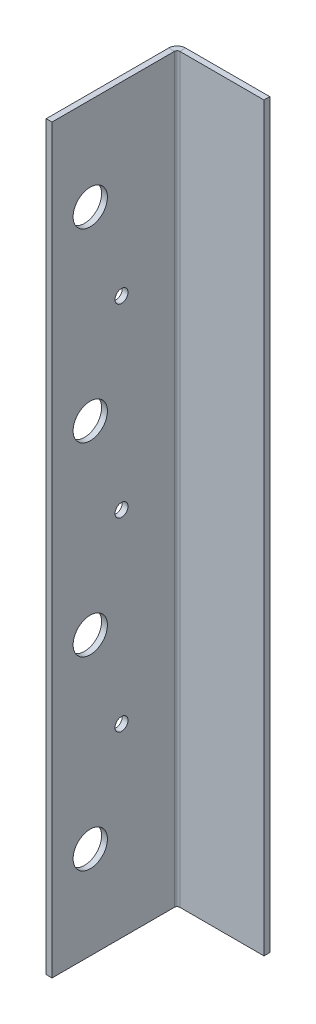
ISO-10303-21;
HEADER;
FILE_DESCRIPTION(('STEP AP214'),'2;1');
FILE_NAME('part.step','',(''),(''),'','','');
FILE_SCHEMA(('AUTOMOTIVE_DESIGN { 1 0 10303 214 1 1 1 1 }'));
ENDSEC;
DATA;
#1=APPLICATION_CONTEXT('core data for automotive mechanical design processes');
#2=APPLICATION_PROTOCOL_DEFINITION('international standard','automotive_design',2000,#1);
#3=PRODUCT_CONTEXT('',#1,'mechanical');
#4=PRODUCT('Part','Part','',(#3));
#5=PRODUCT_RELATED_PRODUCT_CATEGORY('part','',(#4));
#6=PRODUCT_DEFINITION_FORMATION('','',#4);
#7=PRODUCT_DEFINITION_CONTEXT('part definition',#1,'design');
#8=PRODUCT_DEFINITION('design','',#6,#7);
#9=PRODUCT_DEFINITION_SHAPE('','',#8);
#10=(LENGTH_UNIT() NAMED_UNIT(*) SI_UNIT(.MILLI.,.METRE.));
#11=(NAMED_UNIT(*) PLANE_ANGLE_UNIT() SI_UNIT($,.RADIAN.));
#12=(NAMED_UNIT(*) SI_UNIT($,.STERADIAN.) SOLID_ANGLE_UNIT());
#13=UNCERTAINTY_MEASURE_WITH_UNIT(LENGTH_MEASURE(1.E-05),#10,'distance_accuracy_value','');
#14=(GEOMETRIC_REPRESENTATION_CONTEXT(3) GLOBAL_UNCERTAINTY_ASSIGNED_CONTEXT((#13)) GLOBAL_UNIT_ASSIGNED_CONTEXT((#10,
#11,#12)) REPRESENTATION_CONTEXT('',''));
#15=CARTESIAN_POINT('',(0.,0.,0.));
#16=DIRECTION('',(0.,0.,1.));
#17=DIRECTION('',(1.,0.,0.));
#18=AXIS2_PLACEMENT_3D('',#15,#16,#17);
#19=CARTESIAN_POINT('',(-12.7,-101.6,-1.5875));
#20=DIRECTION('',(0.,-1.,0.));
#21=DIRECTION('',(0.,0.,-1.));
#22=AXIS2_PLACEMENT_3D('',#19,#20,#21);
#23=PLANE('',#22);
#24=DIRECTION('',(1.,0.,0.));
#25=VECTOR('',#24,1.);
#26=CARTESIAN_POINT('',(-12.7,-101.6,0.));
#27=LINE('',#26,#25);
#28=CARTESIAN_POINT('',(-10.3759,-101.6,0.));
#29=VERTEX_POINT('',#28);
#30=CARTESIAN_POINT('',(12.7,-101.6,0.));
#31=VERTEX_POINT('',#30);
#32=EDGE_CURVE('E95',#29,#31,#27,.T.);
#33=ORIENTED_EDGE('',*,*,#32,.F.);
#34=DIRECTION('',(0.,0.,-1.));
#35=VECTOR('',#34,1.);
#36=CARTESIAN_POINT('',(-10.3759,-101.6,0.));
#37=LINE('',#36,#35);
#38=CARTESIAN_POINT('',(-10.3759,-101.6,-1.58749999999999));
#39=VERTEX_POINT('',#38);
#40=EDGE_CURVE('E113',#29,#39,#37,.T.);
#41=ORIENTED_EDGE('',*,*,#40,.T.);
#42=DIRECTION('',(1.,0.,0.));
#43=VECTOR('',#42,1.);
#44=CARTESIAN_POINT('',(-12.7,-101.6,-1.5875));
#45=LINE('',#44,#43);
#46=CARTESIAN_POINT('',(12.7,-101.6,-1.5875));
#47=VERTEX_POINT('',#46);
#48=EDGE_CURVE('E80',#39,#47,#45,.T.);
#49=ORIENTED_EDGE('',*,*,#48,.T.);
#50=DIRECTION('',(0.,0.,1.));
#51=VECTOR('',#50,1.);
#52=CARTESIAN_POINT('',(12.7,-101.6,-1.5875));
#53=LINE('',#52,#51);
#54=EDGE_CURVE('E13',#47,#31,#53,.T.);
#55=ORIENTED_EDGE('',*,*,#54,.T.);
#56=EDGE_LOOP('',(#33,#41,#49,#55));
#57=FACE_BOUND('',#56,.T.);
#58=ADVANCED_FACE('F57',(#57),#23,.T.);
#59=CARTESIAN_POINT('',(0.,0.,-1.5875));
#60=DIRECTION('',(0.,0.,-1.));
#61=DIRECTION('',(-1.,0.,0.));
#62=AXIS2_PLACEMENT_3D('',#59,#60,#61);
#63=PLANE('',#62);
#64=ORIENTED_EDGE('',*,*,#48,.F.);
#65=DIRECTION('',(0.,-1.,0.));
#66=VECTOR('',#65,1.);
#67=CARTESIAN_POINT('',(-10.3759,-101.6,-1.58749999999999));
#68=LINE('',#67,#66);
#69=CARTESIAN_POINT('',(-10.3759,101.6,-1.5875));
#70=VERTEX_POINT('',#69);
#71=EDGE_CURVE('E133',#39,#70,#68,.F.);
#72=ORIENTED_EDGE('',*,*,#71,.T.);
#73=DIRECTION('',(-1.,0.,0.));
#74=VECTOR('',#73,1.);
#75=CARTESIAN_POINT('',(-12.7,101.6,-1.5875));
#76=LINE('',#75,#74);
#77=CARTESIAN_POINT('',(12.7,101.6,-1.5875));
#78=VERTEX_POINT('',#77);
#79=EDGE_CURVE('E117',#78,#70,#76,.T.);
#80=ORIENTED_EDGE('',*,*,#79,.F.);
#81=DIRECTION('',(0.,1.,0.));
#82=VECTOR('',#81,1.);
#83=CARTESIAN_POINT('',(12.7,-101.6,-1.5875));
#84=LINE('',#83,#82);
#85=EDGE_CURVE('E103',#47,#78,#84,.T.);
#86=ORIENTED_EDGE('',*,*,#85,.F.);
#87=EDGE_LOOP('',(#64,#72,#80,#86));
#88=FACE_BOUND('',#87,.T.);
#89=ADVANCED_FACE('F283',(#88),#63,.T.);
#90=CARTESIAN_POINT('',(0.,0.,0.));
#91=DIRECTION('',(0.,0.,-1.));
#92=DIRECTION('',(-1.,0.,0.));
#93=AXIS2_PLACEMENT_3D('',#90,#91,#92);
#94=PLANE('',#93);
#95=DIRECTION('',(0.,-1.,0.));
#96=VECTOR('',#95,1.);
#97=CARTESIAN_POINT('',(-10.3759,-101.6,0.));
#98=LINE('',#97,#96);
#99=CARTESIAN_POINT('',(-10.3759,101.6,0.));
#100=VERTEX_POINT('',#99);
#101=EDGE_CURVE('E102',#29,#100,#98,.F.);
#102=ORIENTED_EDGE('',*,*,#101,.F.);
#103=ORIENTED_EDGE('',*,*,#32,.T.);
#104=DIRECTION('',(0.,1.,0.));
#105=VECTOR('',#104,1.);
#106=CARTESIAN_POINT('',(12.7,-101.6,0.));
#107=LINE('',#106,#105);
#108=CARTESIAN_POINT('',(12.7,101.6,0.));
#109=VERTEX_POINT('',#108);
#110=EDGE_CURVE('E99',#31,#109,#107,.T.);
#111=ORIENTED_EDGE('',*,*,#110,.T.);
#112=DIRECTION('',(-1.,0.,0.));
#113=VECTOR('',#112,1.);
#114=CARTESIAN_POINT('',(-12.7,101.6,0.));
#115=LINE('',#114,#113);
#116=EDGE_CURVE('E104',#109,#100,#115,.T.);
#117=ORIENTED_EDGE('',*,*,#116,.T.);
#118=EDGE_LOOP('',(#102,#103,#111,#117));
#119=FACE_BOUND('',#118,.T.);
#120=ADVANCED_FACE('F96',(#119),#94,.F.);
#121=CARTESIAN_POINT('',(12.7,-101.6,-1.5875));
#122=DIRECTION('',(1.,0.,0.));
#123=DIRECTION('',(0.,0.,-1.));
#124=AXIS2_PLACEMENT_3D('',#121,#122,#123);
#125=PLANE('',#124);
#126=ORIENTED_EDGE('',*,*,#110,.F.);
#127=ORIENTED_EDGE('',*,*,#54,.F.);
#128=ORIENTED_EDGE('',*,*,#85,.T.);
#129=DIRECTION('',(0.,0.,1.));
#130=VECTOR('',#129,1.);
#131=CARTESIAN_POINT('',(12.7,101.6,-1.5875));
#132=LINE('',#131,#130);
#133=EDGE_CURVE('E61',#78,#109,#132,.T.);
#134=ORIENTED_EDGE('',*,*,#133,.T.);
#135=EDGE_LOOP('',(#126,#127,#128,#134));
#136=FACE_BOUND('',#135,.T.);
#137=ADVANCED_FACE('F59',(#136),#125,.T.);
#138=CARTESIAN_POINT('',(-12.7,101.6,-1.5875));
#139=DIRECTION('',(0.,1.,0.));
#140=DIRECTION('',(0.,0.,1.));
#141=AXIS2_PLACEMENT_3D('',#138,#139,#140);
#142=PLANE('',#141);
#143=DIRECTION('',(0.,0.,-1.));
#144=VECTOR('',#143,1.);
#145=CARTESIAN_POINT('',(-10.3759,101.6,0.));
#146=LINE('',#145,#144);
#147=EDGE_CURVE('E110',#100,#70,#146,.T.);
#148=ORIENTED_EDGE('',*,*,#147,.F.);
#149=ORIENTED_EDGE('',*,*,#116,.F.);
#150=ORIENTED_EDGE('',*,*,#133,.F.);
#151=ORIENTED_EDGE('',*,*,#79,.T.);
#152=EDGE_LOOP('',(#148,#149,#150,#151));
#153=FACE_BOUND('',#152,.T.);
#154=ADVANCED_FACE('F280',(#153),#142,.T.);
#155=CARTESIAN_POINT('',(-10.3759,101.6,0.736599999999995));
#156=DIRECTION('',(0.,1.,0.));
#157=DIRECTION('',(0.,0.,1.));
#158=AXIS2_PLACEMENT_3D('',#155,#156,#157);
#159=PLANE('',#158);
#160=DIRECTION('',(1.,0.,0.));
#161=VECTOR('',#160,1.);
#162=CARTESIAN_POINT('',(-12.7,101.6,0.736599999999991));
#163=LINE('',#162,#161);
#164=CARTESIAN_POINT('',(-11.1125,101.6,0.736599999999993));
#165=VERTEX_POINT('',#164);
#166=CARTESIAN_POINT('',(-12.7,101.6,0.736599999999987));
#167=VERTEX_POINT('',#166);
#168=EDGE_CURVE('E137',#165,#167,#163,.F.);
#169=ORIENTED_EDGE('',*,*,#168,.F.);
#170=CARTESIAN_POINT('',(-10.3759,101.6,0.736599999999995));
#171=DIRECTION('',(0.,-1.,0.));
#172=DIRECTION('',(0.,0.,-1.));
#173=AXIS2_PLACEMENT_3D('',#170,#171,#172);
#174=CIRCLE('',#173,0.7366);
#175=EDGE_CURVE('E127',#100,#165,#174,.F.);
#176=ORIENTED_EDGE('',*,*,#175,.F.);
#177=ORIENTED_EDGE('',*,*,#147,.T.);
#178=CARTESIAN_POINT('',(-10.3759,101.6,0.736599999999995));
#179=DIRECTION('',(0.,-1.,0.));
#180=DIRECTION('',(0.,0.,-1.));
#181=AXIS2_PLACEMENT_3D('',#178,#179,#180);
#182=CIRCLE('',#181,2.3241);
#183=EDGE_CURVE('E72',#70,#167,#182,.F.);
#184=ORIENTED_EDGE('',*,*,#183,.T.);
#185=EDGE_LOOP('',(#169,#176,#177,#184));
#186=FACE_BOUND('',#185,.T.);
#187=ADVANCED_FACE('F277',(#186),#159,.T.);
#188=CARTESIAN_POINT('',(-10.3759,-101.6,0.73660000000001));
#189=DIRECTION('',(0.,1.,0.));
#190=DIRECTION('',(0.,0.,1.));
#191=AXIS2_PLACEMENT_3D('',#188,#189,#190);
#192=PLANE('',#191);
#193=CARTESIAN_POINT('',(-10.3759,-101.6,0.73660000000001));
#194=DIRECTION('',(0.,-1.,0.));
#195=DIRECTION('',(0.,0.,-1.));
#196=AXIS2_PLACEMENT_3D('',#193,#194,#195);
#197=CIRCLE('',#196,0.7366);
#198=CARTESIAN_POINT('',(-11.1125,-101.6,0.736600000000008));
#199=VERTEX_POINT('',#198);
#200=EDGE_CURVE('E122',#199,#29,#197,.T.);
#201=ORIENTED_EDGE('',*,*,#200,.F.);
#202=DIRECTION('',(1.,0.,0.));
#203=VECTOR('',#202,1.);
#204=CARTESIAN_POINT('',(-11.1125,-101.6,0.736600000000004));
#205=LINE('',#204,#203);
#206=CARTESIAN_POINT('',(-12.7,-101.6,0.736599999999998));
#207=VERTEX_POINT('',#206);
#208=EDGE_CURVE('E144',#199,#207,#205,.F.);
#209=ORIENTED_EDGE('',*,*,#208,.T.);
#210=CARTESIAN_POINT('',(-10.3759,-101.6,0.73660000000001));
#211=DIRECTION('',(0.,-1.,0.));
#212=DIRECTION('',(0.,0.,-1.));
#213=AXIS2_PLACEMENT_3D('',#210,#211,#212);
#214=CIRCLE('',#213,2.3241);
#215=EDGE_CURVE('E130',#207,#39,#214,.T.);
#216=ORIENTED_EDGE('',*,*,#215,.T.);
#217=ORIENTED_EDGE('',*,*,#40,.F.);
#218=EDGE_LOOP('',(#201,#209,#216,#217));
#219=FACE_BOUND('',#218,.T.);
#220=ADVANCED_FACE('F272',(#219),#192,.F.);
#221=CARTESIAN_POINT('',(-10.3759,-101.6,0.73660000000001));
#222=DIRECTION('',(0.,-1.,0.));
#223=DIRECTION('',(-1.,0.,0.));
#224=AXIS2_PLACEMENT_3D('',#221,#222,#223);
#225=CYLINDRICAL_SURFACE('',#224,2.3241);
#226=ORIENTED_EDGE('',*,*,#71,.F.);
#227=ORIENTED_EDGE('',*,*,#215,.F.);
#228=DIRECTION('',(0.,-1.,0.));
#229=VECTOR('',#228,1.);
#230=CARTESIAN_POINT('',(-12.7,101.6,0.736599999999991));
#231=LINE('',#230,#229);
#232=EDGE_CURVE('E147',#207,#167,#231,.F.);
#233=ORIENTED_EDGE('',*,*,#232,.T.);
#234=ORIENTED_EDGE('',*,*,#183,.F.);
#235=EDGE_LOOP('',(#226,#227,#233,#234));
#236=FACE_BOUND('',#235,.T.);
#237=ADVANCED_FACE('F284',(#236),#225,.T.);
#238=CARTESIAN_POINT('',(-10.3759,-101.6,0.73660000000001));
#239=DIRECTION('',(0.,-1.,0.));
#240=DIRECTION('',(-1.,0.,0.));
#241=AXIS2_PLACEMENT_3D('',#238,#239,#240);
#242=CYLINDRICAL_SURFACE('',#241,0.7366);
#243=ORIENTED_EDGE('',*,*,#101,.T.);
#244=ORIENTED_EDGE('',*,*,#175,.T.);
#245=DIRECTION('',(0.,-1.,0.));
#246=VECTOR('',#245,1.);
#247=CARTESIAN_POINT('',(-11.1125,101.6,0.736599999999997));
#248=LINE('',#247,#246);
#249=EDGE_CURVE('E140',#165,#199,#248,.T.);
#250=ORIENTED_EDGE('',*,*,#249,.T.);
#251=ORIENTED_EDGE('',*,*,#200,.T.);
#252=EDGE_LOOP('',(#243,#244,#250,#251));
#253=FACE_BOUND('',#252,.T.);
#254=ADVANCED_FACE('F274',(#253),#242,.F.);
#255=CARTESIAN_POINT('',(-12.7000000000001,-101.6,34.29));
#256=DIRECTION('',(0.,1.,0.));
#257=DIRECTION('',(0.,0.,1.));
#258=AXIS2_PLACEMENT_3D('',#255,#256,#257);
#259=PLANE('',#258);
#260=ORIENTED_EDGE('',*,*,#208,.F.);
#261=DIRECTION('',(0.,0.,-1.));
#262=VECTOR('',#261,1.);
#263=CARTESIAN_POINT('',(-11.1125000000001,-101.6,34.29));
#264=LINE('',#263,#262);
#265=CARTESIAN_POINT('',(-11.1125000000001,-101.6,34.29));
#266=VERTEX_POINT('',#265);
#267=EDGE_CURVE('E149',#199,#266,#264,.F.);
#268=ORIENTED_EDGE('',*,*,#267,.T.);
#269=DIRECTION('',(1.,0.,0.));
#270=VECTOR('',#269,1.);
#271=CARTESIAN_POINT('',(-12.7000000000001,-101.6,34.29));
#272=LINE('',#271,#270);
#273=CARTESIAN_POINT('',(-12.7000000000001,-101.6,34.29));
#274=VERTEX_POINT('',#273);
#275=EDGE_CURVE('E125',#274,#266,#272,.T.);
#276=ORIENTED_EDGE('',*,*,#275,.F.);
#277=DIRECTION('',(0.,0.,1.));
#278=VECTOR('',#277,1.);
#279=CARTESIAN_POINT('',(-12.7,-101.6,0.));
#280=LINE('',#279,#278);
#281=EDGE_CURVE('E158',#207,#274,#280,.T.);
#282=ORIENTED_EDGE('',*,*,#281,.F.);
#283=EDGE_LOOP('',(#260,#268,#276,#282));
#284=FACE_BOUND('',#283,.T.);
#285=ADVANCED_FACE('F243',(#284),#259,.F.);
#286=CARTESIAN_POINT('',(-12.7,101.6,0.));
#287=DIRECTION('',(0.,-1.,0.));
#288=DIRECTION('',(0.,0.,-1.));
#289=AXIS2_PLACEMENT_3D('',#286,#287,#288);
#290=PLANE('',#289);
#291=ORIENTED_EDGE('',*,*,#168,.T.);
#292=DIRECTION('',(0.,0.,-1.));
#293=VECTOR('',#292,1.);
#294=CARTESIAN_POINT('',(-12.7,101.6,0.));
#295=LINE('',#294,#293);
#296=CARTESIAN_POINT('',(-12.7000000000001,101.6,34.29));
#297=VERTEX_POINT('',#296);
#298=EDGE_CURVE('E164',#297,#167,#295,.T.);
#299=ORIENTED_EDGE('',*,*,#298,.F.);
#300=DIRECTION('',(1.,0.,0.));
#301=VECTOR('',#300,1.);
#302=CARTESIAN_POINT('',(-12.7000000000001,101.6,34.29));
#303=LINE('',#302,#301);
#304=CARTESIAN_POINT('',(-11.1125000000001,101.6,34.29));
#305=VERTEX_POINT('',#304);
#306=EDGE_CURVE('E167',#297,#305,#303,.T.);
#307=ORIENTED_EDGE('',*,*,#306,.T.);
#308=DIRECTION('',(0.,0.,1.));
#309=VECTOR('',#308,1.);
#310=CARTESIAN_POINT('',(-11.1125,101.6,0.));
#311=LINE('',#310,#309);
#312=EDGE_CURVE('E155',#305,#165,#311,.F.);
#313=ORIENTED_EDGE('',*,*,#312,.T.);
#314=EDGE_LOOP('',(#291,#299,#307,#313));
#315=FACE_BOUND('',#314,.T.);
#316=ADVANCED_FACE('F286',(#315),#290,.F.);
#317=CARTESIAN_POINT('',(-12.7,0.,0.));
#318=DIRECTION('',(1.,0.,0.));
#319=DIRECTION('',(0.,0.,-1.));
#320=AXIS2_PLACEMENT_3D('',#317,#318,#319);
#321=PLANE('',#320);
#322=CARTESIAN_POINT('',(-12.7000000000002,76.1999999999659,23.8125000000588));
#323=DIRECTION('',(1.,0.,0.));
#324=DIRECTION('',(0.,0.,-1.));
#325=AXIS2_PLACEMENT_3D('',#322,#323,#324);
#326=CIRCLE('',#325,4.69900000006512);
#327=CARTESIAN_POINT('',(-12.7000000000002,76.1999999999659,19.1134999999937));
#328=VERTEX_POINT('',#327);
#329=EDGE_CURVE('E181',#328,#328,#326,.T.);
#330=ORIENTED_EDGE('',*,*,#329,.T.);
#331=EDGE_LOOP('',(#330));
#332=FACE_BOUND('',#331,.T.);
#333=CARTESIAN_POINT('',(-12.7000000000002,25.3999999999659,23.8125000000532));
#334=DIRECTION('',(1.,0.,0.));
#335=DIRECTION('',(0.,0.,-1.));
#336=AXIS2_PLACEMENT_3D('',#333,#334,#335);
#337=CIRCLE('',#336,4.69900000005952);
#338=CARTESIAN_POINT('',(-12.7000000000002,25.3999999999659,19.1134999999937));
#339=VERTEX_POINT('',#338);
#340=EDGE_CURVE('E187',#339,#339,#337,.T.);
#341=ORIENTED_EDGE('',*,*,#340,.T.);
#342=EDGE_LOOP('',(#341));
#343=FACE_BOUND('',#342,.T.);
#344=CARTESIAN_POINT('',(-12.7000000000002,-25.4000000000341,23.8125000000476));
#345=DIRECTION('',(1.,0.,0.));
#346=DIRECTION('',(0.,0.,-1.));
#347=AXIS2_PLACEMENT_3D('',#344,#345,#346);
#348=CIRCLE('',#347,4.69900000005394);
#349=CARTESIAN_POINT('',(-12.7000000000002,-25.4000000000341,19.1134999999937));
#350=VERTEX_POINT('',#349);
#351=EDGE_CURVE('E193',#350,#350,#348,.T.);
#352=ORIENTED_EDGE('',*,*,#351,.T.);
#353=EDGE_LOOP('',(#352));
#354=FACE_BOUND('',#353,.T.);
#355=CARTESIAN_POINT('',(-12.7000000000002,-76.2000000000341,23.812500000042));
#356=DIRECTION('',(1.,0.,0.));
#357=DIRECTION('',(0.,0.,-1.));
#358=AXIS2_PLACEMENT_3D('',#355,#356,#357);
#359=CIRCLE('',#358,4.69900000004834);
#360=CARTESIAN_POINT('',(-12.7000000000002,-76.2000000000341,19.1134999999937));
#361=VERTEX_POINT('',#360);
#362=EDGE_CURVE('E199',#361,#361,#359,.T.);
#363=ORIENTED_EDGE('',*,*,#362,.T.);
#364=EDGE_LOOP('',(#363));
#365=FACE_BOUND('',#364,.T.);
#366=CARTESIAN_POINT('',(-12.7000000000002,-50.7999999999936,15.24));
#367=DIRECTION('',(1.,0.,0.));
#368=DIRECTION('',(0.,0.,-1.));
#369=AXIS2_PLACEMENT_3D('',#366,#367,#368);
#370=CIRCLE('',#369,1.77799999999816);
#371=CARTESIAN_POINT('',(-12.7000000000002,-50.7999999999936,13.4620000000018));
#372=VERTEX_POINT('',#371);
#373=EDGE_CURVE('E205',#372,#372,#370,.T.);
#374=ORIENTED_EDGE('',*,*,#373,.T.);
#375=EDGE_LOOP('',(#374));
#376=FACE_BOUND('',#375,.T.);
#377=CARTESIAN_POINT('',(-12.7000000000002,0.,15.24));
#378=DIRECTION('',(1.,0.,0.));
#379=DIRECTION('',(0.,0.,-1.));
#380=AXIS2_PLACEMENT_3D('',#377,#378,#379);
#381=CIRCLE('',#380,1.778);
#382=CARTESIAN_POINT('',(-12.7000000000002,0.,13.462));
#383=VERTEX_POINT('',#382);
#384=EDGE_CURVE('E175',#383,#383,#381,.T.);
#385=ORIENTED_EDGE('',*,*,#384,.T.);
#386=EDGE_LOOP('',(#385));
#387=FACE_BOUND('',#386,.T.);
#388=CARTESIAN_POINT('',(-12.7000000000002,50.7999999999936,15.24));
#389=DIRECTION('',(1.,0.,0.));
#390=DIRECTION('',(0.,0.,-1.));
#391=AXIS2_PLACEMENT_3D('',#388,#389,#390);
#392=CIRCLE('',#391,1.77800000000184);
#393=CARTESIAN_POINT('',(-12.7000000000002,50.7999999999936,13.4619999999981));
#394=VERTEX_POINT('',#393);
#395=EDGE_CURVE('E141',#394,#394,#392,.T.);
#396=ORIENTED_EDGE('',*,*,#395,.T.);
#397=EDGE_LOOP('',(#396));
#398=FACE_BOUND('',#397,.T.);
#399=ORIENTED_EDGE('',*,*,#232,.F.);
#400=ORIENTED_EDGE('',*,*,#281,.T.);
#401=DIRECTION('',(0.,1.,0.));
#402=VECTOR('',#401,1.);
#403=CARTESIAN_POINT('',(-12.7000000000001,0.,34.29));
#404=LINE('',#403,#402);
#405=EDGE_CURVE('E161',#274,#297,#404,.T.);
#406=ORIENTED_EDGE('',*,*,#405,.T.);
#407=ORIENTED_EDGE('',*,*,#298,.T.);
#408=EDGE_LOOP('',(#399,#400,#406,#407));
#409=FACE_BOUND('',#408,.T.);
#410=ADVANCED_FACE('F214',(#332,#343,#354,#365,#376,#387,#398,#409),#321,.F.);
#411=CARTESIAN_POINT('',(-11.1125,0.,0.));
#412=DIRECTION('',(1.,0.,0.));
#413=DIRECTION('',(0.,0.,-1.));
#414=AXIS2_PLACEMENT_3D('',#411,#412,#413);
#415=PLANE('',#414);
#416=CARTESIAN_POINT('',(-11.1125000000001,76.1999999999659,23.8125000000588));
#417=DIRECTION('',(1.,0.,0.));
#418=DIRECTION('',(0.,0.,-1.));
#419=AXIS2_PLACEMENT_3D('',#416,#417,#418);
#420=CIRCLE('',#419,4.69900000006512);
#421=CARTESIAN_POINT('',(-11.1125000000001,76.1999999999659,19.1134999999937));
#422=VERTEX_POINT('',#421);
#423=EDGE_CURVE('E178',#422,#422,#420,.T.);
#424=ORIENTED_EDGE('',*,*,#423,.F.);
#425=EDGE_LOOP('',(#424));
#426=FACE_BOUND('',#425,.T.);
#427=CARTESIAN_POINT('',(-11.1125000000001,25.3999999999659,23.8125000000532));
#428=DIRECTION('',(1.,0.,0.));
#429=DIRECTION('',(0.,0.,-1.));
#430=AXIS2_PLACEMENT_3D('',#427,#428,#429);
#431=CIRCLE('',#430,4.69900000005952);
#432=CARTESIAN_POINT('',(-11.1125000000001,25.3999999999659,19.1134999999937));
#433=VERTEX_POINT('',#432);
#434=EDGE_CURVE('E184',#433,#433,#431,.T.);
#435=ORIENTED_EDGE('',*,*,#434,.F.);
#436=EDGE_LOOP('',(#435));
#437=FACE_BOUND('',#436,.T.);
#438=CARTESIAN_POINT('',(-11.1125000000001,-25.4000000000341,23.8125000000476));
#439=DIRECTION('',(1.,0.,0.));
#440=DIRECTION('',(0.,0.,-1.));
#441=AXIS2_PLACEMENT_3D('',#438,#439,#440);
#442=CIRCLE('',#441,4.69900000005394);
#443=CARTESIAN_POINT('',(-11.1125000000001,-25.4000000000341,19.1134999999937));
#444=VERTEX_POINT('',#443);
#445=EDGE_CURVE('E190',#444,#444,#442,.T.);
#446=ORIENTED_EDGE('',*,*,#445,.F.);
#447=EDGE_LOOP('',(#446));
#448=FACE_BOUND('',#447,.T.);
#449=CARTESIAN_POINT('',(-11.1125000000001,-76.2000000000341,23.812500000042));
#450=DIRECTION('',(1.,0.,0.));
#451=DIRECTION('',(0.,0.,-1.));
#452=AXIS2_PLACEMENT_3D('',#449,#450,#451);
#453=CIRCLE('',#452,4.69900000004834);
#454=CARTESIAN_POINT('',(-11.1125000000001,-76.2000000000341,19.1134999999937));
#455=VERTEX_POINT('',#454);
#456=EDGE_CURVE('E196',#455,#455,#453,.T.);
#457=ORIENTED_EDGE('',*,*,#456,.F.);
#458=EDGE_LOOP('',(#457));
#459=FACE_BOUND('',#458,.T.);
#460=CARTESIAN_POINT('',(-11.1125000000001,-50.7999999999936,15.24));
#461=DIRECTION('',(1.,0.,0.));
#462=DIRECTION('',(0.,0.,-1.));
#463=AXIS2_PLACEMENT_3D('',#460,#461,#462);
#464=CIRCLE('',#463,1.77799999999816);
#465=CARTESIAN_POINT('',(-11.1125,-50.7999999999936,13.4620000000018));
#466=VERTEX_POINT('',#465);
#467=EDGE_CURVE('E202',#466,#466,#464,.T.);
#468=ORIENTED_EDGE('',*,*,#467,.F.);
#469=EDGE_LOOP('',(#468));
#470=FACE_BOUND('',#469,.T.);
#471=CARTESIAN_POINT('',(-11.1125000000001,0.,15.24));
#472=DIRECTION('',(1.,0.,0.));
#473=DIRECTION('',(0.,0.,-1.));
#474=AXIS2_PLACEMENT_3D('',#471,#472,#473);
#475=CIRCLE('',#474,1.778);
#476=CARTESIAN_POINT('',(-11.1125,0.,13.462));
#477=VERTEX_POINT('',#476);
#478=EDGE_CURVE('E208',#477,#477,#475,.T.);
#479=ORIENTED_EDGE('',*,*,#478,.F.);
#480=EDGE_LOOP('',(#479));
#481=FACE_BOUND('',#480,.T.);
#482=CARTESIAN_POINT('',(-11.1125000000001,50.7999999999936,15.24));
#483=DIRECTION('',(1.,0.,0.));
#484=DIRECTION('',(0.,0.,-1.));
#485=AXIS2_PLACEMENT_3D('',#482,#483,#484);
#486=CIRCLE('',#485,1.77800000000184);
#487=CARTESIAN_POINT('',(-11.1125,50.7999999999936,13.4619999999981));
#488=VERTEX_POINT('',#487);
#489=EDGE_CURVE('E172',#488,#488,#486,.T.);
#490=ORIENTED_EDGE('',*,*,#489,.F.);
#491=EDGE_LOOP('',(#490));
#492=FACE_BOUND('',#491,.T.);
#493=ORIENTED_EDGE('',*,*,#267,.F.);
#494=ORIENTED_EDGE('',*,*,#249,.F.);
#495=ORIENTED_EDGE('',*,*,#312,.F.);
#496=DIRECTION('',(0.,-1.,0.));
#497=VECTOR('',#496,1.);
#498=CARTESIAN_POINT('',(-11.1125000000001,-101.6,34.29));
#499=LINE('',#498,#497);
#500=EDGE_CURVE('E152',#266,#305,#499,.F.);
#501=ORIENTED_EDGE('',*,*,#500,.F.);
#502=EDGE_LOOP('',(#493,#494,#495,#501));
#503=FACE_BOUND('',#502,.T.);
#504=ADVANCED_FACE('F225',(#426,#437,#448,#459,#470,#481,#492,#503),#415,.T.);
#505=CARTESIAN_POINT('',(-12.7000000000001,-101.6,34.29));
#506=DIRECTION('',(0.,0.,-1.));
#507=DIRECTION('',(-1.,0.,0.));
#508=AXIS2_PLACEMENT_3D('',#505,#506,#507);
#509=PLANE('',#508);
#510=ORIENTED_EDGE('',*,*,#500,.T.);
#511=ORIENTED_EDGE('',*,*,#306,.F.);
#512=ORIENTED_EDGE('',*,*,#405,.F.);
#513=ORIENTED_EDGE('',*,*,#275,.T.);
#514=EDGE_LOOP('',(#510,#511,#512,#513));
#515=FACE_BOUND('',#514,.T.);
#516=ADVANCED_FACE('F228',(#515),#509,.F.);
#517=CARTESIAN_POINT('',(-12.7000000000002,50.7999999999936,15.24));
#518=DIRECTION('',(1.,0.,0.));
#519=DIRECTION('',(0.,0.,-1.));
#520=AXIS2_PLACEMENT_3D('',#517,#518,#519);
#521=CYLINDRICAL_SURFACE('',#520,1.77800000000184);
#522=ORIENTED_EDGE('',*,*,#395,.F.);
#523=EDGE_LOOP('',(#522));
#524=FACE_BOUND('',#523,.T.);
#525=ORIENTED_EDGE('',*,*,#489,.T.);
#526=EDGE_LOOP('',(#525));
#527=FACE_BOUND('',#526,.T.);
#528=ADVANCED_FACE('F221',(#524,#527),#521,.F.);
#529=CARTESIAN_POINT('',(-12.7000000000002,0.,15.24));
#530=DIRECTION('',(1.,0.,0.));
#531=DIRECTION('',(0.,0.,-1.));
#532=AXIS2_PLACEMENT_3D('',#529,#530,#531);
#533=CYLINDRICAL_SURFACE('',#532,1.778);
#534=ORIENTED_EDGE('',*,*,#384,.F.);
#535=EDGE_LOOP('',(#534));
#536=FACE_BOUND('',#535,.T.);
#537=ORIENTED_EDGE('',*,*,#478,.T.);
#538=EDGE_LOOP('',(#537));
#539=FACE_BOUND('',#538,.T.);
#540=ADVANCED_FACE('F217',(#536,#539),#533,.F.);
#541=CARTESIAN_POINT('',(-12.7000000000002,-50.7999999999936,15.24));
#542=DIRECTION('',(1.,0.,0.));
#543=DIRECTION('',(0.,0.,-1.));
#544=AXIS2_PLACEMENT_3D('',#541,#542,#543);
#545=CYLINDRICAL_SURFACE('',#544,1.77799999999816);
#546=ORIENTED_EDGE('',*,*,#373,.F.);
#547=EDGE_LOOP('',(#546));
#548=FACE_BOUND('',#547,.T.);
#549=ORIENTED_EDGE('',*,*,#467,.T.);
#550=EDGE_LOOP('',(#549));
#551=FACE_BOUND('',#550,.T.);
#552=ADVANCED_FACE('F220',(#548,#551),#545,.F.);
#553=CARTESIAN_POINT('',(-12.7000000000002,-76.2000000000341,23.812500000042));
#554=DIRECTION('',(1.,0.,0.));
#555=DIRECTION('',(0.,0.,-1.));
#556=AXIS2_PLACEMENT_3D('',#553,#554,#555);
#557=CYLINDRICAL_SURFACE('',#556,4.69900000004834);
#558=ORIENTED_EDGE('',*,*,#362,.F.);
#559=EDGE_LOOP('',(#558));
#560=FACE_BOUND('',#559,.T.);
#561=ORIENTED_EDGE('',*,*,#456,.T.);
#562=EDGE_LOOP('',(#561));
#563=FACE_BOUND('',#562,.T.);
#564=ADVANCED_FACE('F440',(#560,#563),#557,.F.);
#565=CARTESIAN_POINT('',(-12.7000000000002,-25.4000000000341,23.8125000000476));
#566=DIRECTION('',(1.,0.,0.));
#567=DIRECTION('',(0.,0.,-1.));
#568=AXIS2_PLACEMENT_3D('',#565,#566,#567);
#569=CYLINDRICAL_SURFACE('',#568,4.69900000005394);
#570=ORIENTED_EDGE('',*,*,#351,.F.);
#571=EDGE_LOOP('',(#570));
#572=FACE_BOUND('',#571,.T.);
#573=ORIENTED_EDGE('',*,*,#445,.T.);
#574=EDGE_LOOP('',(#573));
#575=FACE_BOUND('',#574,.T.);
#576=ADVANCED_FACE('F451',(#572,#575),#569,.F.);
#577=CARTESIAN_POINT('',(-12.7000000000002,25.3999999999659,23.8125000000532));
#578=DIRECTION('',(1.,0.,0.));
#579=DIRECTION('',(0.,0.,-1.));
#580=AXIS2_PLACEMENT_3D('',#577,#578,#579);
#581=CYLINDRICAL_SURFACE('',#580,4.69900000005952);
#582=ORIENTED_EDGE('',*,*,#340,.F.);
#583=EDGE_LOOP('',(#582));
#584=FACE_BOUND('',#583,.T.);
#585=ORIENTED_EDGE('',*,*,#434,.T.);
#586=EDGE_LOOP('',(#585));
#587=FACE_BOUND('',#586,.T.);
#588=ADVANCED_FACE('F462',(#584,#587),#581,.F.);
#589=CARTESIAN_POINT('',(-12.7000000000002,76.1999999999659,23.8125000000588));
#590=DIRECTION('',(1.,0.,0.));
#591=DIRECTION('',(0.,0.,-1.));
#592=AXIS2_PLACEMENT_3D('',#589,#590,#591);
#593=CYLINDRICAL_SURFACE('',#592,4.69900000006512);
#594=ORIENTED_EDGE('',*,*,#329,.F.);
#595=EDGE_LOOP('',(#594));
#596=FACE_BOUND('',#595,.T.);
#597=ORIENTED_EDGE('',*,*,#423,.T.);
#598=EDGE_LOOP('',(#597));
#599=FACE_BOUND('',#598,.T.);
#600=ADVANCED_FACE('F473',(#596,#599),#593,.F.);
#601=CLOSED_SHELL('',(#58,#89,#120,#137,#154,#187,#220,#237,#254,#285,#316,#410,#504,#516,#528,
#540,#552,#564,#576,#588,#600));
#602=MANIFOLD_SOLID_BREP('B2',#601);
#603=ADVANCED_BREP_SHAPE_REPRESENTATION('',(#18,#602),#14);
#604=SHAPE_DEFINITION_REPRESENTATION(#9,#603);
ENDSEC;
END-ISO-10303-21;
